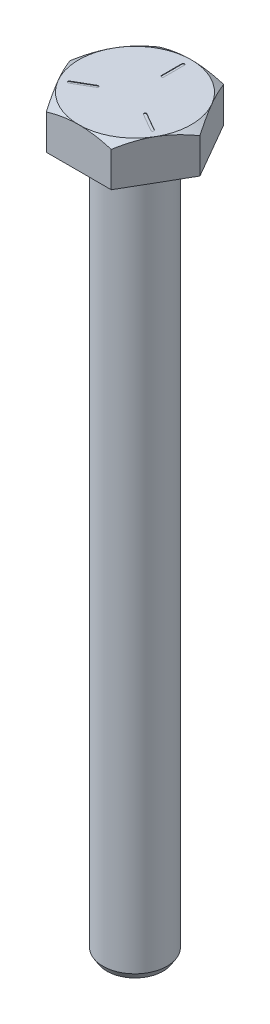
ISO-10303-21;
HEADER;
FILE_DESCRIPTION(('STEP AP214'),'2;1');
FILE_NAME('part.step','',(''),(''),'','','');
FILE_SCHEMA(('AUTOMOTIVE_DESIGN { 1 0 10303 214 1 1 1 1 }'));
ENDSEC;
DATA;
#1=APPLICATION_CONTEXT('core data for automotive mechanical design processes');
#2=APPLICATION_PROTOCOL_DEFINITION('international standard','automotive_design',2000,#1);
#3=PRODUCT_CONTEXT('',#1,'mechanical');
#4=PRODUCT('Part','Part','',(#3));
#5=PRODUCT_RELATED_PRODUCT_CATEGORY('part','',(#4));
#6=PRODUCT_DEFINITION_FORMATION('','',#4);
#7=PRODUCT_DEFINITION_CONTEXT('part definition',#1,'design');
#8=PRODUCT_DEFINITION('design','',#6,#7);
#9=PRODUCT_DEFINITION_SHAPE('','',#8);
#10=(LENGTH_UNIT() NAMED_UNIT(*) SI_UNIT(.MILLI.,.METRE.));
#11=(NAMED_UNIT(*) PLANE_ANGLE_UNIT() SI_UNIT($,.RADIAN.));
#12=(NAMED_UNIT(*) SI_UNIT($,.STERADIAN.) SOLID_ANGLE_UNIT());
#13=UNCERTAINTY_MEASURE_WITH_UNIT(LENGTH_MEASURE(1.E-05),#10,'distance_accuracy_value','');
#14=(GEOMETRIC_REPRESENTATION_CONTEXT(3) GLOBAL_UNCERTAINTY_ASSIGNED_CONTEXT((#13)) GLOBAL_UNIT_ASSIGNED_CONTEXT((#10,
#11,#12)) REPRESENTATION_CONTEXT('',''));
#15=CARTESIAN_POINT('',(0.,0.,0.));
#16=DIRECTION('',(0.,0.,1.));
#17=DIRECTION('',(1.,0.,0.));
#18=AXIS2_PLACEMENT_3D('',#15,#16,#17);
#19=CARTESIAN_POINT('',(0.,3.9624,0.));
#20=DIRECTION('',(0.,1.,0.));
#21=DIRECTION('',(0.,0.,1.));
#22=AXIS2_PLACEMENT_3D('',#19,#20,#21);
#23=PLANE('',#22);
#24=CARTESIAN_POINT('',(0.,3.9624,0.));
#25=DIRECTION('',(0.,1.,0.));
#26=DIRECTION('',(0.,0.,1.));
#27=AXIS2_PLACEMENT_3D('',#24,#25,#26);
#28=CIRCLE('',#27,5.55625);
#29=CARTESIAN_POINT('',(0.,3.9624,5.55625));
#30=VERTEX_POINT('',#29);
#31=CARTESIAN_POINT('',(-4.81185364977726,3.9624,2.77812500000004));
#32=VERTEX_POINT('',#31);
#33=EDGE_CURVE('E11',#30,#32,#28,.F.);
#34=ORIENTED_EDGE('',*,*,#33,.F.);
#35=CARTESIAN_POINT('',(0.,3.9624,0.));
#36=DIRECTION('',(0.,-1.,0.));
#37=DIRECTION('',(1.,0.,0.));
#38=AXIS2_PLACEMENT_3D('',#35,#36,#37);
#39=CIRCLE('',#38,5.55625);
#40=CARTESIAN_POINT('',(4.8118536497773,3.9624,2.77812499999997));
#41=VERTEX_POINT('',#40);
#42=EDGE_CURVE('E199',#41,#30,#39,.T.);
#43=ORIENTED_EDGE('',*,*,#42,.F.);
#44=CARTESIAN_POINT('',(4.81185364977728,3.9624,-2.778125));
#45=VERTEX_POINT('',#44);
#46=EDGE_CURVE('E42',#45,#41,#28,.F.);
#47=ORIENTED_EDGE('',*,*,#46,.F.);
#48=CARTESIAN_POINT('',(0.,3.9624,-5.55625));
#49=VERTEX_POINT('',#48);
#50=EDGE_CURVE('E521',#49,#45,#28,.F.);
#51=ORIENTED_EDGE('',*,*,#50,.F.);
#52=CARTESIAN_POINT('',(-4.8118536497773,3.9624,-2.77812499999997));
#53=VERTEX_POINT('',#52);
#54=EDGE_CURVE('E523',#53,#49,#28,.F.);
#55=ORIENTED_EDGE('',*,*,#54,.F.);
#56=EDGE_CURVE('E41',#32,#53,#28,.F.);
#57=ORIENTED_EDGE('',*,*,#56,.F.);
#58=EDGE_LOOP('',(#34,#43,#47,#51,#55,#57));
#59=FACE_BOUND('',#58,.T.);
#60=DIRECTION('',(0.866025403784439,0.,0.5));
#61=VECTOR('',#60,1.);
#62=CARTESIAN_POINT('',(4.18794598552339,3.9624,2.27126477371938));
#63=LINE('',#62,#61);
#64=CARTESIAN_POINT('',(2.42818236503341,3.9624,1.25526477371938));
#65=VERTEX_POINT('',#64);
#66=CARTESIAN_POINT('',(4.18794598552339,3.9624,2.27126477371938));
#67=VERTEX_POINT('',#66);
#68=EDGE_CURVE('E241',#65,#67,#63,.T.);
#69=ORIENTED_EDGE('',*,*,#68,.T.);
#70=CARTESIAN_POINT('',(4.12444598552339,3.9624,2.38125));
#71=DIRECTION('',(0.,-1.,0.));
#72=DIRECTION('',(0.,0.,-1.));
#73=AXIS2_PLACEMENT_3D('',#70,#71,#72);
#74=CIRCLE('',#73,0.127);
#75=CARTESIAN_POINT('',(4.06094598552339,3.9624,2.49123522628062));
#76=VERTEX_POINT('',#75);
#77=EDGE_CURVE('E248',#67,#76,#74,.T.);
#78=ORIENTED_EDGE('',*,*,#77,.T.);
#79=DIRECTION('',(-0.866025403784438,0.,-0.5));
#80=VECTOR('',#79,1.);
#81=CARTESIAN_POINT('',(4.06094598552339,3.9624,2.49123522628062));
#82=LINE('',#81,#80);
#83=CARTESIAN_POINT('',(2.30118236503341,3.9624,1.47523522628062));
#84=VERTEX_POINT('',#83);
#85=EDGE_CURVE('E251',#76,#84,#82,.T.);
#86=ORIENTED_EDGE('',*,*,#85,.T.);
#87=CARTESIAN_POINT('',(2.36468236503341,3.9624,1.36525));
#88=DIRECTION('',(0.,-1.,0.));
#89=DIRECTION('',(0.,0.,-1.));
#90=AXIS2_PLACEMENT_3D('',#87,#88,#89);
#91=CIRCLE('',#90,0.127);
#92=EDGE_CURVE('E255',#84,#65,#91,.T.);
#93=ORIENTED_EDGE('',*,*,#92,.T.);
#94=EDGE_LOOP('',(#69,#78,#86,#93));
#95=FACE_BOUND('',#94,.T.);
#96=DIRECTION('',(-0.866025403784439,0.,0.5));
#97=VECTOR('',#96,1.);
#98=CARTESIAN_POINT('',(-4.06094598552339,3.9624,2.49123522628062));
#99=LINE('',#98,#97);
#100=CARTESIAN_POINT('',(-2.30118236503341,3.9624,1.47523522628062));
#101=VERTEX_POINT('',#100);
#102=CARTESIAN_POINT('',(-4.06094598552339,3.9624,2.49123522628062));
#103=VERTEX_POINT('',#102);
#104=EDGE_CURVE('E213',#101,#103,#99,.T.);
#105=ORIENTED_EDGE('',*,*,#104,.T.);
#106=CARTESIAN_POINT('',(-4.12444598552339,3.9624,2.38125));
#107=DIRECTION('',(0.,-1.,0.));
#108=DIRECTION('',(0.,0.,-1.));
#109=AXIS2_PLACEMENT_3D('',#106,#107,#108);
#110=CIRCLE('',#109,0.127);
#111=CARTESIAN_POINT('',(-4.18794598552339,3.9624,2.27126477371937));
#112=VERTEX_POINT('',#111);
#113=EDGE_CURVE('E57',#103,#112,#110,.T.);
#114=ORIENTED_EDGE('',*,*,#113,.T.);
#115=DIRECTION('',(0.866025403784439,0.,-0.5));
#116=VECTOR('',#115,1.);
#117=CARTESIAN_POINT('',(-4.18794598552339,3.9624,2.27126477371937));
#118=LINE('',#117,#116);
#119=CARTESIAN_POINT('',(-2.42818236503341,3.9624,1.25526477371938));
#120=VERTEX_POINT('',#119);
#121=EDGE_CURVE('E221',#112,#120,#118,.T.);
#122=ORIENTED_EDGE('',*,*,#121,.T.);
#123=CARTESIAN_POINT('',(-2.36468236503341,3.9624,1.36525));
#124=DIRECTION('',(0.,-1.,0.));
#125=DIRECTION('',(0.,0.,-1.));
#126=AXIS2_PLACEMENT_3D('',#123,#124,#125);
#127=CIRCLE('',#126,0.127);
#128=EDGE_CURVE('E225',#120,#101,#127,.T.);
#129=ORIENTED_EDGE('',*,*,#128,.T.);
#130=EDGE_LOOP('',(#105,#114,#122,#129));
#131=FACE_BOUND('',#130,.T.);
#132=DIRECTION('',(0.,0.,-1.));
#133=VECTOR('',#132,1.);
#134=CARTESIAN_POINT('',(-0.127,3.9624,-4.7625));
#135=LINE('',#134,#133);
#136=CARTESIAN_POINT('',(-0.127,3.9624,-2.7305));
#137=VERTEX_POINT('',#136);
#138=CARTESIAN_POINT('',(-0.127,3.9624,-4.7625));
#139=VERTEX_POINT('',#138);
#140=EDGE_CURVE('E194',#137,#139,#135,.T.);
#141=ORIENTED_EDGE('',*,*,#140,.T.);
#142=CARTESIAN_POINT('',(0.,3.9624,-4.7625));
#143=DIRECTION('',(0.,-1.,0.));
#144=DIRECTION('',(0.,0.,-1.));
#145=AXIS2_PLACEMENT_3D('',#142,#143,#144);
#146=CIRCLE('',#145,0.127);
#147=CARTESIAN_POINT('',(0.127,3.9624,-4.7625));
#148=VERTEX_POINT('',#147);
#149=EDGE_CURVE('E49',#139,#148,#146,.T.);
#150=ORIENTED_EDGE('',*,*,#149,.T.);
#151=DIRECTION('',(0.,0.,1.));
#152=VECTOR('',#151,1.);
#153=CARTESIAN_POINT('',(0.127,3.9624,-4.7625));
#154=LINE('',#153,#152);
#155=CARTESIAN_POINT('',(0.127,3.9624,-2.7305));
#156=VERTEX_POINT('',#155);
#157=EDGE_CURVE('E198',#148,#156,#154,.T.);
#158=ORIENTED_EDGE('',*,*,#157,.T.);
#159=CARTESIAN_POINT('',(0.,3.9624,-2.7305));
#160=DIRECTION('',(0.,-1.,0.));
#161=DIRECTION('',(0.,0.,-1.));
#162=AXIS2_PLACEMENT_3D('',#159,#160,#161);
#163=CIRCLE('',#162,0.127);
#164=EDGE_CURVE('E372',#156,#137,#163,.T.);
#165=ORIENTED_EDGE('',*,*,#164,.T.);
#166=EDGE_LOOP('',(#141,#150,#158,#165));
#167=FACE_BOUND('',#166,.T.);
#168=ADVANCED_FACE('F32',(#59,#95,#131,#167),#23,.T.);
#169=CARTESIAN_POINT('',(3.20790243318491,3.9624,5.55624999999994));
#170=DIRECTION('',(-0.866025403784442,0.,-0.499999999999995));
#171=DIRECTION('',(-0.499999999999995,0.,0.866025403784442));
#172=AXIS2_PLACEMENT_3D('',#169,#170,#171);
#173=PLANE('',#172);
#174=DIRECTION('',(0.,-1.,0.));
#175=VECTOR('',#174,1.);
#176=CARTESIAN_POINT('',(6.41580486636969,3.9624,0.));
#177=LINE('',#176,#175);
#178=CARTESIAN_POINT('',(6.41580486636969,3.4544,0.));
#179=VERTEX_POINT('',#178);
#180=CARTESIAN_POINT('',(6.41580486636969,0.,0.));
#181=VERTEX_POINT('',#180);
#182=EDGE_CURVE('E498',#179,#181,#177,.T.);
#183=ORIENTED_EDGE('',*,*,#182,.F.);
#184=CARTESIAN_POINT('',(6.41592033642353,3.45433175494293,-0.0002));
#185=CARTESIAN_POINT('',(6.34525728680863,3.49608770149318,0.122191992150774));
#186=CARTESIAN_POINT('',(6.2743186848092,3.53595207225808,0.245061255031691));
#187=CARTESIAN_POINT('',(6.13183759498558,3.61136937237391,0.491845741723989));
#188=CARTESIAN_POINT('',(6.06029484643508,3.64692032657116,0.615761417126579));
#189=CARTESIAN_POINT('',(5.84446209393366,3.74640067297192,0.989594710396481));
#190=CARTESIAN_POINT('',(5.69927852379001,3.8029688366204,1.24106003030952));
#191=CARTESIAN_POINT('',(5.48203887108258,3.86918211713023,1.61733014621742));
#192=CARTESIAN_POINT('',(5.41066401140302,3.88801355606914,1.74095502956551));
#193=CARTESIAN_POINT('',(5.26757723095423,3.91954792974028,1.98878860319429));
#194=CARTESIAN_POINT('',(5.19586534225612,3.9322514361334,2.11299723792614));
#195=CARTESIAN_POINT('',(5.05231394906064,3.95119916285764,2.361635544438));
#196=CARTESIAN_POINT('',(4.980474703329,3.9574511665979,2.48606476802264));
#197=CARTESIAN_POINT('',(4.83673361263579,3.96336736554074,2.73503164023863));
#198=CARTESIAN_POINT('',(4.76483176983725,3.9630317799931,2.85956928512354));
#199=CARTESIAN_POINT('',(4.56856862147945,3.9530985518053,3.19950702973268));
#200=CARTESIAN_POINT('',(4.44427753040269,3.93691024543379,3.41478551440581));
#201=CARTESIAN_POINT('',(4.19656247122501,3.88592740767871,3.84384058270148));
#202=CARTESIAN_POINT('',(4.07313946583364,3.85111476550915,4.0576154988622));
#203=CARTESIAN_POINT('',(3.82491070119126,3.76422634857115,4.48756033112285));
#204=CARTESIAN_POINT('',(3.70013908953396,3.71176954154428,4.70367110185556));
#205=CARTESIAN_POINT('',(3.45253692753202,3.5928355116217,5.13253062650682));
#206=CARTESIAN_POINT('',(3.32970290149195,3.52638745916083,5.34528540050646));
#207=CARTESIAN_POINT('',(3.20778696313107,3.45433175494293,5.55644999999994));
#208=B_SPLINE_CURVE_WITH_KNOTS('',3,(#184,#185,#186,#187,#188,#189,#190,#191,#192,#193,#194,
#195,#196,#197,#198,#199,#200,#201,#202,#203,#204,#205,#206,#207),.UNSPECIFIED.,.F.,.F.,(4,2,2,
2,2,2,2,2,2,2,2,4),(0.,0.442059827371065,0.884321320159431,1.77079067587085,2.20264380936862,
2.63445664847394,3.06574791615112,3.49702482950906,4.2435368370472,4.99077609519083,
5.7553162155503,6.51827785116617),.UNSPECIFIED.);
#209=EDGE_CURVE('E495',#179,#41,#208,.T.);
#210=ORIENTED_EDGE('',*,*,#209,.T.);
#211=CARTESIAN_POINT('',(3.20790243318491,3.4544,5.55624999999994));
#212=VERTEX_POINT('',#211);
#213=EDGE_CURVE('E304',#41,#212,#208,.T.);
#214=ORIENTED_EDGE('',*,*,#213,.T.);
#215=DIRECTION('',(0.,-1.,0.));
#216=VECTOR('',#215,1.);
#217=CARTESIAN_POINT('',(3.20790243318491,3.9624,5.55624999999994));
#218=LINE('',#217,#216);
#219=CARTESIAN_POINT('',(3.20790243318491,0.,5.55624999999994));
#220=VERTEX_POINT('',#219);
#221=EDGE_CURVE('E503',#212,#220,#218,.T.);
#222=ORIENTED_EDGE('',*,*,#221,.T.);
#223=DIRECTION('',(0.499999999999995,0.,-0.866025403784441));
#224=VECTOR('',#223,1.);
#225=CARTESIAN_POINT('',(3.20790243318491,0.,5.55624999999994));
#226=LINE('',#225,#224);
#227=EDGE_CURVE('E539',#220,#181,#226,.T.);
#228=ORIENTED_EDGE('',*,*,#227,.T.);
#229=EDGE_LOOP('',(#183,#210,#214,#222,#228));
#230=FACE_BOUND('',#229,.T.);
#231=ADVANCED_FACE('F34',(#230),#173,.F.);
#232=CARTESIAN_POINT('',(6.41580486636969,3.9624,0.));
#233=DIRECTION('',(-0.866025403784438,0.,0.500000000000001));
#234=DIRECTION('',(0.500000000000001,0.,0.866025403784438));
#235=AXIS2_PLACEMENT_3D('',#232,#233,#234);
#236=PLANE('',#235);
#237=DIRECTION('',(0.,-1.,0.));
#238=VECTOR('',#237,1.);
#239=CARTESIAN_POINT('',(3.20790243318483,3.9624,-5.55624999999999));
#240=LINE('',#239,#238);
#241=CARTESIAN_POINT('',(3.20790243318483,3.4544,-5.55624999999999));
#242=VERTEX_POINT('',#241);
#243=CARTESIAN_POINT('',(3.20790243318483,0.,-5.55624999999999));
#244=VERTEX_POINT('',#243);
#245=EDGE_CURVE('E518',#242,#244,#240,.T.);
#246=ORIENTED_EDGE('',*,*,#245,.F.);
#247=CARTESIAN_POINT('',(3.20778696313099,3.45433175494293,-5.55644999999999));
#248=CARTESIAN_POINT('',(3.2784500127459,3.49608770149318,-5.43405800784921));
#249=CARTESIAN_POINT('',(3.34938861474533,3.53595207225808,-5.3111887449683));
#250=CARTESIAN_POINT('',(3.49186970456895,3.61136937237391,-5.064404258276));
#251=CARTESIAN_POINT('',(3.56341245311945,3.64692032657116,-4.94048858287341));
#252=CARTESIAN_POINT('',(3.77924520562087,3.74640067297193,-4.56665528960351));
#253=CARTESIAN_POINT('',(3.92442877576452,3.80296883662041,-4.31518996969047));
#254=CARTESIAN_POINT('',(4.14166842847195,3.86918211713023,-3.93891985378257));
#255=CARTESIAN_POINT('',(4.21304328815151,3.88801355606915,-3.81529497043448));
#256=CARTESIAN_POINT('',(4.35613006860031,3.91954792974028,-3.56746139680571));
#257=CARTESIAN_POINT('',(4.42784195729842,3.93225143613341,-3.44325276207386));
#258=CARTESIAN_POINT('',(4.5713933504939,3.95119916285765,-3.194614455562));
#259=CARTESIAN_POINT('',(4.64323259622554,3.95745116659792,-3.07018523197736));
#260=CARTESIAN_POINT('',(4.78697368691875,3.96336736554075,-2.82121835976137));
#261=CARTESIAN_POINT('',(4.85887552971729,3.96303177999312,-2.69668071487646));
#262=CARTESIAN_POINT('',(5.0551386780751,3.95309855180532,-2.35674297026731));
#263=CARTESIAN_POINT('',(5.17942976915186,3.9369102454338,-2.14146448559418));
#264=CARTESIAN_POINT('',(5.42714482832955,3.88592740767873,-1.7124094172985));
#265=CARTESIAN_POINT('',(5.55056783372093,3.85111476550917,-1.49863450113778));
#266=CARTESIAN_POINT('',(5.79879659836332,3.76422634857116,-1.06868966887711));
#267=CARTESIAN_POINT('',(5.92356821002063,3.71176954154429,-0.852578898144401));
#268=CARTESIAN_POINT('',(6.17117037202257,3.59283551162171,-0.423719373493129));
#269=CARTESIAN_POINT('',(6.29400439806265,3.52638745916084,-0.210964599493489));
#270=CARTESIAN_POINT('',(6.41592033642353,3.45433175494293,0.000200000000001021));
#271=B_SPLINE_CURVE_WITH_KNOTS('',3,(#247,#248,#249,#250,#251,#252,#253,#254,#255,#256,#257,
#258,#259,#260,#261,#262,#263,#264,#265,#266,#267,#268,#269,#270),.UNSPECIFIED.,.F.,.F.,(4,2,2,
2,2,2,2,2,2,2,2,4),(0.,0.442059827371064,0.884321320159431,1.77079067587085,2.20264380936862,
2.63445664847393,3.06574791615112,3.49702482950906,4.24353683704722,4.99077609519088,
5.75531621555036,6.51827785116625),.UNSPECIFIED.);
#272=EDGE_CURVE('E323',#242,#45,#271,.T.);
#273=ORIENTED_EDGE('',*,*,#272,.T.);
#274=EDGE_CURVE('E317',#45,#179,#271,.T.);
#275=ORIENTED_EDGE('',*,*,#274,.T.);
#276=ORIENTED_EDGE('',*,*,#182,.T.);
#277=DIRECTION('',(-0.500000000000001,0.,-0.866025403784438));
#278=VECTOR('',#277,1.);
#279=CARTESIAN_POINT('',(6.41580486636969,0.,0.));
#280=LINE('',#279,#278);
#281=EDGE_CURVE('E540',#181,#244,#280,.T.);
#282=ORIENTED_EDGE('',*,*,#281,.T.);
#283=EDGE_LOOP('',(#246,#273,#275,#276,#282));
#284=FACE_BOUND('',#283,.T.);
#285=ADVANCED_FACE('F331',(#284),#236,.F.);
#286=CARTESIAN_POINT('',(3.20790243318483,3.9624,-5.55624999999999));
#287=DIRECTION('',(0.,0.,1.));
#288=DIRECTION('',(1.,0.,0.));
#289=AXIS2_PLACEMENT_3D('',#286,#287,#288);
#290=PLANE('',#289);
#291=DIRECTION('',(0.,-1.,0.));
#292=VECTOR('',#291,1.);
#293=CARTESIAN_POINT('',(-3.20790243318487,3.9624,-5.55624999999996));
#294=LINE('',#293,#292);
#295=CARTESIAN_POINT('',(-3.20790243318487,3.4544,-5.55624999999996));
#296=VERTEX_POINT('',#295);
#297=CARTESIAN_POINT('',(-3.20790243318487,0.,-5.55624999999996));
#298=VERTEX_POINT('',#297);
#299=EDGE_CURVE('E516',#296,#298,#294,.T.);
#300=ORIENTED_EDGE('',*,*,#299,.F.);
#301=CARTESIAN_POINT('',(-9.64398746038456,0.668253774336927,-5.55624999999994));
#302=CARTESIAN_POINT('',(-9.41845867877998,0.783728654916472,-5.55624999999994));
#303=CARTESIAN_POINT('',(-9.19253036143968,0.898430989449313,-5.55624999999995));
#304=CARTESIAN_POINT('',(-8.73969781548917,1.12592725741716,-5.55624999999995));
#305=CARTESIAN_POINT('',(-8.51279352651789,1.23872107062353,-5.55624999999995));
#306=CARTESIAN_POINT('',(-8.05743404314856,1.46223170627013,-5.55624999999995));
#307=CARTESIAN_POINT('',(-7.82897673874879,1.57294423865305,-5.55624999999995));
#308=CARTESIAN_POINT('',(-7.37073056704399,1.79157256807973,-5.55624999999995));
#309=CARTESIAN_POINT('',(-7.14094172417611,1.89948841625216,-5.55624999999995));
#310=CARTESIAN_POINT('',(-6.6692381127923,2.11674940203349,-5.55624999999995));
#311=CARTESIAN_POINT('',(-6.42724930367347,2.22593428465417,-5.55624999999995));
#312=CARTESIAN_POINT('',(-5.94121021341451,2.43961089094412,-5.55624999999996));
#313=CARTESIAN_POINT('',(-5.69715999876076,2.5441027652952,-5.55624999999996));
#314=CARTESIAN_POINT('',(-5.20672896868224,2.7471044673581,-5.55624999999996));
#315=CARTESIAN_POINT('',(-4.96034952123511,2.84561758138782,-5.55624999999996));
#316=CARTESIAN_POINT('',(-4.46471370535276,3.03508638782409,-5.55624999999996));
#317=CARTESIAN_POINT('',(-4.21545762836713,3.12604283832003,-5.55624999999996));
#318=CARTESIAN_POINT('',(-3.65491811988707,3.31847041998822,-5.55624999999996));
#319=CARTESIAN_POINT('',(-3.34275939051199,3.41742695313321,-5.55624999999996));
#320=CARTESIAN_POINT('',(-2.71269101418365,3.59558398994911,-5.55624999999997));
#321=CARTESIAN_POINT('',(-2.39478151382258,3.67478499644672,-5.55624999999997));
#322=CARTESIAN_POINT('',(-1.91666726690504,3.77360947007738,-5.55624999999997));
#323=CARTESIAN_POINT('',(-1.75847647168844,3.80304839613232,-5.55624999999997));
#324=CARTESIAN_POINT('',(-1.44096533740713,3.85496489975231,-5.55624999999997));
#325=CARTESIAN_POINT('',(-1.2816451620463,3.87744346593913,-5.55624999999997));
#326=CARTESIAN_POINT('',(-0.962160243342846,3.91481307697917,-5.55624999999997));
#327=CARTESIAN_POINT('',(-0.801995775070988,3.92970645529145,-5.55624999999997));
#328=CARTESIAN_POINT('',(-0.481117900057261,3.95145821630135,-5.55624999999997));
#329=CARTESIAN_POINT('',(-0.320404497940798,3.9583166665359,-5.55624999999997));
#330=CARTESIAN_POINT('',(0.00254855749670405,3.96379729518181,-5.55624999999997));
#331=CARTESIAN_POINT('',(0.164789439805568,3.96234806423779,-5.55624999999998));
#332=CARTESIAN_POINT('',(0.488978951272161,3.95109605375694,-5.55624999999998));
#333=CARTESIAN_POINT('',(0.650927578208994,3.9412932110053,-5.55624999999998));
#334=CARTESIAN_POINT('',(0.974174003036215,3.91365045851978,-5.55624999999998));
#335=CARTESIAN_POINT('',(1.1354716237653,3.89580849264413,-5.55624999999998));
#336=CARTESIAN_POINT('',(1.45706960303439,3.85262859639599,-5.55624999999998));
#337=CARTESIAN_POINT('',(1.61736980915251,3.82728954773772,-5.55624999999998));
#338=CARTESIAN_POINT('',(2.10204742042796,3.74002376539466,-5.55624999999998));
#339=CARTESIAN_POINT('',(2.42451495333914,3.66737375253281,-5.55624999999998));
#340=CARTESIAN_POINT('',(3.06356333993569,3.50016427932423,-5.55624999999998));
#341=CARTESIAN_POINT('',(3.38014339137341,3.40560185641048,-5.55624999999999));
#342=CARTESIAN_POINT('',(3.95798444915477,3.21651884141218,-5.55624999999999));
#343=CARTESIAN_POINT('',(4.22003782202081,3.12438216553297,-5.55624999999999));
#344=CARTESIAN_POINT('',(4.74084627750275,2.93117288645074,-5.55624999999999));
#345=CARTESIAN_POINT('',(4.99960089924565,2.83009904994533,-5.55624999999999));
#346=CARTESIAN_POINT('',(5.51448209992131,2.62096288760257,-5.55624999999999));
#347=CARTESIAN_POINT('',(5.77060652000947,2.51289528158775,-5.55624999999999));
#348=CARTESIAN_POINT('',(6.28048347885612,2.29136310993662,-5.55625));
#349=CARTESIAN_POINT('',(6.53423614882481,2.17789884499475,-5.55625));
#350=CARTESIAN_POINT('',(7.02823725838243,1.95198859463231,-5.55625));
#351=CARTESIAN_POINT('',(7.26857302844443,1.83973290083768,-5.55625));
#352=CARTESIAN_POINT('',(7.74775886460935,1.61208629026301,-5.55625));
#353=CARTESIAN_POINT('',(7.98660889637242,1.49669530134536,-5.55625));
#354=CARTESIAN_POINT('',(8.4624876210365,1.26364627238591,-5.55625));
#355=CARTESIAN_POINT('',(8.69951930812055,1.14599433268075,-5.55625));
#356=CARTESIAN_POINT('',(9.17250797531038,0.90859257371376,-5.55625));
#357=CARTESIAN_POINT('',(9.40846503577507,0.788842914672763,-5.55625000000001));
#358=CARTESIAN_POINT('',(9.64398746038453,0.668253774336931,-5.55625000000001));
#359=B_SPLINE_CURVE_WITH_KNOTS('',3,(#301,#302,#303,#304,#305,#306,#307,#308,#309,#310,#311,
#312,#313,#314,#315,#316,#317,#318,#319,#320,#321,#322,#323,#324,#325,#326,#327,#328,#329,#330,
#331,#332,#333,#334,#335,#336,#337,#338,#339,#340,#341,#342,#343,#344,#345,#346,#347,#348,#349,
#350,#351,#352,#353,#354,#355,#356,#357,#358),.UNSPECIFIED.,.F.,.F.,(4,2,2,2,2,2,2,2,2,2,2,2,2,
2,2,2,2,2,2,2,2,2,2,2,2,2,2,2,4),(0.,0.760121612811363,1.52029093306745,2.28188531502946,
3.04346576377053,3.8398678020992,4.63624425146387,5.43217891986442,6.22803364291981,
7.2099847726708,8.19191090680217,8.67450244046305,9.15702539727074,9.63939982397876,
10.1217701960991,10.6082930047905,11.0948194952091,11.5814704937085,12.0681941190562,
13.0587120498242,14.0493639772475,14.8825044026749,15.7157599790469,16.5496521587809,
17.3834979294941,18.1792496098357,18.9750196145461,19.7688812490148,20.5626825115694),.UNSPECIFIED.);
#360=EDGE_CURVE('E536',#296,#49,#359,.T.);
#361=ORIENTED_EDGE('',*,*,#360,.T.);
#362=EDGE_CURVE('E324',#49,#242,#359,.T.);
#363=ORIENTED_EDGE('',*,*,#362,.T.);
#364=ORIENTED_EDGE('',*,*,#245,.T.);
#365=DIRECTION('',(-1.,0.,0.));
#366=VECTOR('',#365,1.);
#367=CARTESIAN_POINT('',(3.20790243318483,0.,-5.55624999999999));
#368=LINE('',#367,#366);
#369=EDGE_CURVE('E541',#244,#298,#368,.T.);
#370=ORIENTED_EDGE('',*,*,#369,.T.);
#371=EDGE_LOOP('',(#300,#361,#363,#364,#370));
#372=FACE_BOUND('',#371,.T.);
#373=ADVANCED_FACE('F334',(#372),#290,.F.);
#374=CARTESIAN_POINT('',(-3.20790243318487,3.9624,-5.55624999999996));
#375=DIRECTION('',(0.866025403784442,0.,0.499999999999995));
#376=DIRECTION('',(0.499999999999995,0.,-0.866025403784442));
#377=AXIS2_PLACEMENT_3D('',#374,#375,#376);
#378=PLANE('',#377);
#379=DIRECTION('',(0.,-1.,0.));
#380=VECTOR('',#379,1.);
#381=CARTESIAN_POINT('',(-6.41580486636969,3.9624,0.));
#382=LINE('',#381,#380);
#383=CARTESIAN_POINT('',(-6.41580486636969,3.4544,0.));
#384=VERTEX_POINT('',#383);
#385=CARTESIAN_POINT('',(-6.41580486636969,0.,0.));
#386=VERTEX_POINT('',#385);
#387=EDGE_CURVE('E509',#384,#386,#382,.T.);
#388=ORIENTED_EDGE('',*,*,#387,.F.);
#389=CARTESIAN_POINT('',(-6.41592033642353,3.45433175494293,0.000200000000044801));
#390=CARTESIAN_POINT('',(-6.34525728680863,3.49608770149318,-0.122191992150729));
#391=CARTESIAN_POINT('',(-6.2743186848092,3.53595207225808,-0.245061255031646));
#392=CARTESIAN_POINT('',(-6.13183759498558,3.61136937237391,-0.491845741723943));
#393=CARTESIAN_POINT('',(-6.06029484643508,3.64692032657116,-0.615761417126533));
#394=CARTESIAN_POINT('',(-5.84446209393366,3.74640067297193,-0.989594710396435));
#395=CARTESIAN_POINT('',(-5.69927852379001,3.80296883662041,-1.24106003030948));
#396=CARTESIAN_POINT('',(-5.48203887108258,3.86918211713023,-1.61733014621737));
#397=CARTESIAN_POINT('',(-5.41066401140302,3.88801355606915,-1.74095502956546));
#398=CARTESIAN_POINT('',(-5.26757723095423,3.91954792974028,-1.98878860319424));
#399=CARTESIAN_POINT('',(-5.19586534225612,3.93225143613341,-2.11299723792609));
#400=CARTESIAN_POINT('',(-5.05231394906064,3.95119916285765,-2.36163554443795));
#401=CARTESIAN_POINT('',(-4.980474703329,3.95745116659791,-2.48606476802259));
#402=CARTESIAN_POINT('',(-4.83673361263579,3.96336736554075,-2.73503164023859));
#403=CARTESIAN_POINT('',(-4.76483176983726,3.96303177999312,-2.85956928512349));
#404=CARTESIAN_POINT('',(-4.56856862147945,3.95309855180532,-3.19950702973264));
#405=CARTESIAN_POINT('',(-4.44427753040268,3.9369102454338,-3.41478551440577));
#406=CARTESIAN_POINT('',(-4.196562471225,3.88592740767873,-3.84384058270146));
#407=CARTESIAN_POINT('',(-4.07313946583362,3.85111476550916,-4.05761549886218));
#408=CARTESIAN_POINT('',(-3.82491070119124,3.76422634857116,-4.48756033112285));
#409=CARTESIAN_POINT('',(-3.70013908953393,3.71176954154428,-4.70367110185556));
#410=CARTESIAN_POINT('',(-3.45253692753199,3.59283551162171,-5.13253062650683));
#411=CARTESIAN_POINT('',(-3.32970290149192,3.52638745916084,-5.34528540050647));
#412=CARTESIAN_POINT('',(-3.20778696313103,3.45433175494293,-5.55644999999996));
#413=B_SPLINE_CURVE_WITH_KNOTS('',3,(#389,#390,#391,#392,#393,#394,#395,#396,#397,#398,#399,
#400,#401,#402,#403,#404,#405,#406,#407,#408,#409,#410,#411,#412),.UNSPECIFIED.,.F.,.F.,(4,2,2,
2,2,2,2,2,2,2,2,4),(0.,0.442059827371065,0.88432132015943,1.77079067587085,2.20264380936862,
2.63445664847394,3.06574791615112,3.49702482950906,4.24353683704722,4.99077609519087,
5.75531621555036,6.51827785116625),.UNSPECIFIED.);
#414=EDGE_CURVE('E310',#384,#53,#413,.T.);
#415=ORIENTED_EDGE('',*,*,#414,.T.);
#416=EDGE_CURVE('E532',#53,#296,#413,.T.);
#417=ORIENTED_EDGE('',*,*,#416,.T.);
#418=ORIENTED_EDGE('',*,*,#299,.T.);
#419=DIRECTION('',(-0.499999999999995,0.,0.866025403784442));
#420=VECTOR('',#419,1.);
#421=CARTESIAN_POINT('',(-3.20790243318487,0.,-5.55624999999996));
#422=LINE('',#421,#420);
#423=EDGE_CURVE('E545',#298,#386,#422,.T.);
#424=ORIENTED_EDGE('',*,*,#423,.T.);
#425=EDGE_LOOP('',(#388,#415,#417,#418,#424));
#426=FACE_BOUND('',#425,.T.);
#427=ADVANCED_FACE('F338',(#426),#378,.F.);
#428=CARTESIAN_POINT('',(-6.41580486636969,3.9624,0.));
#429=DIRECTION('',(0.866025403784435,0.,-0.500000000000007));
#430=DIRECTION('',(-0.500000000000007,0.,-0.866025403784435));
#431=AXIS2_PLACEMENT_3D('',#428,#429,#430);
#432=PLANE('',#431);
#433=DIRECTION('',(0.,-1.,0.));
#434=VECTOR('',#433,1.);
#435=CARTESIAN_POINT('',(-3.20790243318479,3.9624,5.55625000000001));
#436=LINE('',#435,#434);
#437=CARTESIAN_POINT('',(-3.20790243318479,3.4544,5.55625000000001));
#438=VERTEX_POINT('',#437);
#439=CARTESIAN_POINT('',(-3.20790243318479,0.,5.55625000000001));
#440=VERTEX_POINT('',#439);
#441=EDGE_CURVE('E507',#438,#440,#436,.T.);
#442=ORIENTED_EDGE('',*,*,#441,.F.);
#443=CARTESIAN_POINT('',(-3.20778696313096,3.45433175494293,5.55645000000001));
#444=CARTESIAN_POINT('',(-3.27845001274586,3.49608770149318,5.43405800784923));
#445=CARTESIAN_POINT('',(-3.34938861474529,3.53595207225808,5.31118874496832));
#446=CARTESIAN_POINT('',(-3.49186970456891,3.61136937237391,5.06440425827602));
#447=CARTESIAN_POINT('',(-3.56341245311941,3.64692032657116,4.94048858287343));
#448=CARTESIAN_POINT('',(-3.77924520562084,3.74640067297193,4.56665528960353));
#449=CARTESIAN_POINT('',(-3.92442877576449,3.80296883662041,4.3151899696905));
#450=CARTESIAN_POINT('',(-4.14166842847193,3.86918211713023,3.9389198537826));
#451=CARTESIAN_POINT('',(-4.21304328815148,3.88801355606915,3.81529497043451));
#452=CARTESIAN_POINT('',(-4.35613006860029,3.91954792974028,3.56746139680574));
#453=CARTESIAN_POINT('',(-4.4278419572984,3.93225143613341,3.44325276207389));
#454=CARTESIAN_POINT('',(-4.57139335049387,3.95119916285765,3.19461445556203));
#455=CARTESIAN_POINT('',(-4.64323259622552,3.95745116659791,3.07018523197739));
#456=CARTESIAN_POINT('',(-4.78697368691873,3.96336736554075,2.8212183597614));
#457=CARTESIAN_POINT('',(-4.85887552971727,3.96303177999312,2.6966807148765));
#458=CARTESIAN_POINT('',(-5.05513867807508,3.95309855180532,2.35674297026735));
#459=CARTESIAN_POINT('',(-5.17942976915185,3.9369102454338,2.14146448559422));
#460=CARTESIAN_POINT('',(-5.42714482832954,3.88592740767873,1.71240941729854));
#461=CARTESIAN_POINT('',(-5.55056783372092,3.85111476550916,1.49863450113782));
#462=CARTESIAN_POINT('',(-5.79879659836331,3.76422634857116,1.06868966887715));
#463=CARTESIAN_POINT('',(-5.92356821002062,3.71176954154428,0.852578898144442));
#464=CARTESIAN_POINT('',(-6.17117037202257,3.5928355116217,0.423719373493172));
#465=CARTESIAN_POINT('',(-6.29400439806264,3.52638745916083,0.210964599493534));
#466=CARTESIAN_POINT('',(-6.41592033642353,3.45433175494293,-0.000199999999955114));
#467=B_SPLINE_CURVE_WITH_KNOTS('',3,(#443,#444,#445,#446,#447,#448,#449,#450,#451,#452,#453,
#454,#455,#456,#457,#458,#459,#460,#461,#462,#463,#464,#465,#466),.UNSPECIFIED.,.F.,.F.,(4,2,2,
2,2,2,2,2,2,2,2,4),(0.,0.442059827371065,0.88432132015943,1.77079067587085,2.20264380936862,
2.63445664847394,3.06574791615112,3.49702482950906,4.24353683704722,4.99077609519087,
5.75531621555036,6.51827785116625),.UNSPECIFIED.);
#468=EDGE_CURVE('E277',#438,#32,#467,.T.);
#469=ORIENTED_EDGE('',*,*,#468,.T.);
#470=EDGE_CURVE('E499',#32,#384,#467,.T.);
#471=ORIENTED_EDGE('',*,*,#470,.T.);
#472=ORIENTED_EDGE('',*,*,#387,.T.);
#473=DIRECTION('',(0.500000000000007,0.,0.866025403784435));
#474=VECTOR('',#473,1.);
#475=CARTESIAN_POINT('',(-6.41580486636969,0.,0.));
#476=LINE('',#475,#474);
#477=EDGE_CURVE('E511',#386,#440,#476,.T.);
#478=ORIENTED_EDGE('',*,*,#477,.T.);
#479=EDGE_LOOP('',(#442,#469,#471,#472,#478));
#480=FACE_BOUND('',#479,.T.);
#481=ADVANCED_FACE('F342',(#480),#432,.F.);
#482=CARTESIAN_POINT('',(-3.20790243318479,3.9624,5.55625000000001));
#483=DIRECTION('',(0.,0.,-1.));
#484=DIRECTION('',(-1.,0.,0.));
#485=AXIS2_PLACEMENT_3D('',#482,#483,#484);
#486=PLANE('',#485);
#487=ORIENTED_EDGE('',*,*,#221,.F.);
#488=CARTESIAN_POINT('',(9.6439874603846,0.668253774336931,5.55624999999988));
#489=CARTESIAN_POINT('',(9.41845867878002,0.783728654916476,5.55624999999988));
#490=CARTESIAN_POINT('',(9.19253036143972,0.898430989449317,5.55624999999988));
#491=CARTESIAN_POINT('',(8.7396978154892,1.12592725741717,5.55624999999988));
#492=CARTESIAN_POINT('',(8.51279352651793,1.23872107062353,5.55624999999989));
#493=CARTESIAN_POINT('',(8.0574340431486,1.46223170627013,5.55624999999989));
#494=CARTESIAN_POINT('',(7.82897673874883,1.57294423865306,5.55624999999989));
#495=CARTESIAN_POINT('',(7.37073056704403,1.79157256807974,5.5562499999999));
#496=CARTESIAN_POINT('',(7.14094172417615,1.89948841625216,5.5562499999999));
#497=CARTESIAN_POINT('',(6.66923811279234,2.11674940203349,5.55624999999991));
#498=CARTESIAN_POINT('',(6.42724930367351,2.22593428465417,5.55624999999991));
#499=CARTESIAN_POINT('',(5.94121021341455,2.43961089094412,5.55624999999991));
#500=CARTESIAN_POINT('',(5.6971599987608,2.54410276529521,5.55624999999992));
#501=CARTESIAN_POINT('',(5.20672896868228,2.7471044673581,5.55624999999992));
#502=CARTESIAN_POINT('',(4.96034952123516,2.84561758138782,5.55624999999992));
#503=CARTESIAN_POINT('',(4.4647137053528,3.03508638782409,5.55624999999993));
#504=CARTESIAN_POINT('',(4.21545762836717,3.12604283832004,5.55624999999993));
#505=CARTESIAN_POINT('',(3.65491811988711,3.31847041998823,5.55624999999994));
#506=CARTESIAN_POINT('',(3.34275939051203,3.41742695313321,5.55624999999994));
#507=CARTESIAN_POINT('',(2.71269101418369,3.59558398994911,5.55624999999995));
#508=CARTESIAN_POINT('',(2.39478151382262,3.67478499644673,5.55624999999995));
#509=CARTESIAN_POINT('',(1.91666726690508,3.77360947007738,5.55624999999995));
#510=CARTESIAN_POINT('',(1.75847647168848,3.80304839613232,5.55624999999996));
#511=CARTESIAN_POINT('',(1.44096533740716,3.85496489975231,5.55624999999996));
#512=CARTESIAN_POINT('',(1.28164516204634,3.87744346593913,5.55624999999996));
#513=CARTESIAN_POINT('',(0.962160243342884,3.91481307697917,5.55624999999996));
#514=CARTESIAN_POINT('',(0.801995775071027,3.92970645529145,5.55624999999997));
#515=CARTESIAN_POINT('',(0.481117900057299,3.95145821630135,5.55624999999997));
#516=CARTESIAN_POINT('',(0.320404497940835,3.9583166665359,5.55624999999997));
#517=CARTESIAN_POINT('',(-0.00254855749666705,3.96379729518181,5.55624999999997));
#518=CARTESIAN_POINT('',(-0.164789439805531,3.96234806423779,5.55624999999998));
#519=CARTESIAN_POINT('',(-0.488978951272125,3.95109605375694,5.55624999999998));
#520=CARTESIAN_POINT('',(-0.650927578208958,3.9412932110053,5.55624999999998));
#521=CARTESIAN_POINT('',(-0.974174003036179,3.91365045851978,5.55624999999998));
#522=CARTESIAN_POINT('',(-1.13547162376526,3.89580849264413,5.55624999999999));
#523=CARTESIAN_POINT('',(-1.45706960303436,3.85262859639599,5.55624999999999));
#524=CARTESIAN_POINT('',(-1.61736980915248,3.82728954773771,5.55624999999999));
#525=CARTESIAN_POINT('',(-2.10204742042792,3.74002376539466,5.55625));
#526=CARTESIAN_POINT('',(-2.4245149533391,3.66737375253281,5.55625));
#527=CARTESIAN_POINT('',(-3.06356333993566,3.50016427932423,5.55625000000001));
#528=CARTESIAN_POINT('',(-3.38014339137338,3.40560185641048,5.55625000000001));
#529=CARTESIAN_POINT('',(-3.95798444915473,3.21651884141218,5.55625000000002));
#530=CARTESIAN_POINT('',(-4.22003782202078,3.12438216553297,5.55625000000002));
#531=CARTESIAN_POINT('',(-4.74084627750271,2.93117288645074,5.55625000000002));
#532=CARTESIAN_POINT('',(-4.99960089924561,2.83009904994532,5.55625000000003));
#533=CARTESIAN_POINT('',(-5.51448209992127,2.62096288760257,5.55625000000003));
#534=CARTESIAN_POINT('',(-5.77060652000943,2.51289528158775,5.55625000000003));
#535=CARTESIAN_POINT('',(-6.28048347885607,2.29136310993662,5.55625000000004));
#536=CARTESIAN_POINT('',(-6.53423614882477,2.17789884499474,5.55625000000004));
#537=CARTESIAN_POINT('',(-7.02823725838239,1.95198859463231,5.55625000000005));
#538=CARTESIAN_POINT('',(-7.26857302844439,1.83973290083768,5.55625000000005));
#539=CARTESIAN_POINT('',(-7.74775886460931,1.61208629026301,5.55625000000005));
#540=CARTESIAN_POINT('',(-7.98660889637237,1.49669530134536,5.55625000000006));
#541=CARTESIAN_POINT('',(-8.46248762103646,1.26364627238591,5.55625000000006));
#542=CARTESIAN_POINT('',(-8.69951930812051,1.14599433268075,5.55625000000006));
#543=CARTESIAN_POINT('',(-9.17250797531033,0.908592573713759,5.55625000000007));
#544=CARTESIAN_POINT('',(-9.40846503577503,0.788842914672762,5.55625000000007));
#545=CARTESIAN_POINT('',(-9.64398746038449,0.668253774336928,5.55625000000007));
#546=B_SPLINE_CURVE_WITH_KNOTS('',3,(#488,#489,#490,#491,#492,#493,#494,#495,#496,#497,#498,
#499,#500,#501,#502,#503,#504,#505,#506,#507,#508,#509,#510,#511,#512,#513,#514,#515,#516,#517,
#518,#519,#520,#521,#522,#523,#524,#525,#526,#527,#528,#529,#530,#531,#532,#533,#534,#535,#536,
#537,#538,#539,#540,#541,#542,#543,#544,#545),.UNSPECIFIED.,.F.,.F.,(4,2,2,2,2,2,2,2,2,2,2,2,2,
2,2,2,2,2,2,2,2,2,2,2,2,2,2,2,4),(0.,0.760121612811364,1.52029093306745,2.28188531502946,
3.04346576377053,3.8398678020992,4.63624425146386,5.43217891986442,6.2280336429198,
7.2099847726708,8.19191090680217,8.67450244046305,9.15702539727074,9.63939982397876,
10.1217701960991,10.6082930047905,11.0948194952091,11.5814704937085,12.0681941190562,
13.0587120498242,14.0493639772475,14.8825044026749,15.7157599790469,16.5496521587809,
17.3834979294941,18.1792496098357,18.9750196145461,19.7688812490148,20.5626825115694),.UNSPECIFIED.);
#547=EDGE_CURVE('E276',#212,#30,#546,.T.);
#548=ORIENTED_EDGE('',*,*,#547,.T.);
#549=EDGE_CURVE('E203',#30,#438,#546,.T.);
#550=ORIENTED_EDGE('',*,*,#549,.T.);
#551=ORIENTED_EDGE('',*,*,#441,.T.);
#552=DIRECTION('',(1.,0.,0.));
#553=VECTOR('',#552,1.);
#554=CARTESIAN_POINT('',(-3.20790243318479,0.,5.55625000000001));
#555=LINE('',#554,#553);
#556=EDGE_CURVE('E505',#440,#220,#555,.T.);
#557=ORIENTED_EDGE('',*,*,#556,.T.);
#558=EDGE_LOOP('',(#487,#548,#550,#551,#557));
#559=FACE_BOUND('',#558,.T.);
#560=ADVANCED_FACE('F284',(#559),#486,.F.);
#561=CARTESIAN_POINT('',(0.,0.,0.));
#562=DIRECTION('',(0.,1.,0.));
#563=DIRECTION('',(0.,0.,1.));
#564=AXIS2_PLACEMENT_3D('',#561,#562,#563);
#565=PLANE('',#564);
#566=CARTESIAN_POINT('',(0.,0.,0.));
#567=DIRECTION('',(0.,1.,0.));
#568=DIRECTION('',(-1.,0.,0.));
#569=AXIS2_PLACEMENT_3D('',#566,#567,#568);
#570=CIRCLE('',#569,3.175);
#571=CARTESIAN_POINT('',(-3.175,0.,0.));
#572=VERTEX_POINT('',#571);
#573=EDGE_CURVE('E392',#572,#572,#570,.T.);
#574=ORIENTED_EDGE('',*,*,#573,.T.);
#575=EDGE_LOOP('',(#574));
#576=FACE_BOUND('',#575,.T.);
#577=ORIENTED_EDGE('',*,*,#227,.F.);
#578=ORIENTED_EDGE('',*,*,#556,.F.);
#579=ORIENTED_EDGE('',*,*,#477,.F.);
#580=ORIENTED_EDGE('',*,*,#423,.F.);
#581=ORIENTED_EDGE('',*,*,#369,.F.);
#582=ORIENTED_EDGE('',*,*,#281,.F.);
#583=EDGE_LOOP('',(#577,#578,#579,#580,#581,#582));
#584=FACE_BOUND('',#583,.T.);
#585=ADVANCED_FACE('F350',(#576,#584),#565,.F.);
#586=CARTESIAN_POINT('',(0.,3.9624,0.));
#587=DIRECTION('',(0.,-1.,0.));
#588=DIRECTION('',(1.,0.,0.));
#589=AXIS2_PLACEMENT_3D('',#586,#587,#588);
#590=CONICAL_SURFACE('',#589,5.55625,1.03701810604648);
#591=ORIENTED_EDGE('',*,*,#42,.T.);
#592=ORIENTED_EDGE('',*,*,#547,.F.);
#593=ORIENTED_EDGE('',*,*,#213,.F.);
#594=EDGE_LOOP('',(#591,#592,#593));
#595=FACE_BOUND('',#594,.T.);
#596=ADVANCED_FACE('F475',(#595),#590,.T.);
#597=ORIENTED_EDGE('',*,*,#46,.T.);
#598=ORIENTED_EDGE('',*,*,#209,.F.);
#599=ORIENTED_EDGE('',*,*,#274,.F.);
#600=EDGE_LOOP('',(#597,#598,#599));
#601=FACE_BOUND('',#600,.T.);
#602=ADVANCED_FACE('F480',(#601),#590,.T.);
#603=ORIENTED_EDGE('',*,*,#50,.T.);
#604=ORIENTED_EDGE('',*,*,#272,.F.);
#605=ORIENTED_EDGE('',*,*,#362,.F.);
#606=EDGE_LOOP('',(#603,#604,#605));
#607=FACE_BOUND('',#606,.T.);
#608=ADVANCED_FACE('F293',(#607),#590,.T.);
#609=ORIENTED_EDGE('',*,*,#416,.F.);
#610=ORIENTED_EDGE('',*,*,#54,.T.);
#611=ORIENTED_EDGE('',*,*,#360,.F.);
#612=EDGE_LOOP('',(#609,#610,#611));
#613=FACE_BOUND('',#612,.T.);
#614=ADVANCED_FACE('F287',(#613),#590,.T.);
#615=ORIENTED_EDGE('',*,*,#470,.F.);
#616=ORIENTED_EDGE('',*,*,#56,.T.);
#617=ORIENTED_EDGE('',*,*,#414,.F.);
#618=EDGE_LOOP('',(#615,#616,#617));
#619=FACE_BOUND('',#618,.T.);
#620=ADVANCED_FACE('F292',(#619),#590,.T.);
#621=ORIENTED_EDGE('',*,*,#549,.F.);
#622=ORIENTED_EDGE('',*,*,#33,.T.);
#623=ORIENTED_EDGE('',*,*,#468,.F.);
#624=EDGE_LOOP('',(#621,#622,#623));
#625=FACE_BOUND('',#624,.T.);
#626=ADVANCED_FACE('F295',(#625),#590,.T.);
#627=CARTESIAN_POINT('',(4.12444598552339,3.9116,2.38125));
#628=DIRECTION('',(0.,1.,0.));
#629=DIRECTION('',(0.,0.,1.));
#630=AXIS2_PLACEMENT_3D('',#627,#628,#629);
#631=CYLINDRICAL_SURFACE('',#630,0.127);
#632=ORIENTED_EDGE('',*,*,#77,.F.);
#633=DIRECTION('',(0.,1.,0.));
#634=VECTOR('',#633,1.);
#635=CARTESIAN_POINT('',(4.18794598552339,3.9116,2.27126477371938));
#636=LINE('',#635,#634);
#637=CARTESIAN_POINT('',(4.18794598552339,3.9116,2.27126477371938));
#638=VERTEX_POINT('',#637);
#639=EDGE_CURVE('E247',#638,#67,#636,.T.);
#640=ORIENTED_EDGE('',*,*,#639,.F.);
#641=CARTESIAN_POINT('',(4.12444598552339,3.9116,2.38125));
#642=DIRECTION('',(0.,-1.,0.));
#643=DIRECTION('',(0.,0.,-1.));
#644=AXIS2_PLACEMENT_3D('',#641,#642,#643);
#645=CIRCLE('',#644,0.127);
#646=CARTESIAN_POINT('',(4.06094598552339,3.9116,2.49123522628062));
#647=VERTEX_POINT('',#646);
#648=EDGE_CURVE('E237',#638,#647,#645,.T.);
#649=ORIENTED_EDGE('',*,*,#648,.T.);
#650=DIRECTION('',(0.,1.,0.));
#651=VECTOR('',#650,1.);
#652=CARTESIAN_POINT('',(4.06094598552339,3.9116,2.49123522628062));
#653=LINE('',#652,#651);
#654=EDGE_CURVE('E222',#647,#76,#653,.T.);
#655=ORIENTED_EDGE('',*,*,#654,.T.);
#656=EDGE_LOOP('',(#632,#640,#649,#655));
#657=FACE_BOUND('',#656,.T.);
#658=ADVANCED_FACE('F296',(#657),#631,.F.);
#659=CARTESIAN_POINT('',(4.06094598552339,3.9116,2.49123522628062));
#660=DIRECTION('',(0.5,0.,-0.866025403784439));
#661=DIRECTION('',(-0.866025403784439,0.,-0.5));
#662=AXIS2_PLACEMENT_3D('',#659,#660,#661);
#663=PLANE('',#662);
#664=ORIENTED_EDGE('',*,*,#85,.F.);
#665=ORIENTED_EDGE('',*,*,#654,.F.);
#666=DIRECTION('',(-0.866025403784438,0.,-0.5));
#667=VECTOR('',#666,1.);
#668=CARTESIAN_POINT('',(4.06094598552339,3.9116,2.49123522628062));
#669=LINE('',#668,#667);
#670=CARTESIAN_POINT('',(2.30118236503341,3.9116,1.47523522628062));
#671=VERTEX_POINT('',#670);
#672=EDGE_CURVE('E240',#647,#671,#669,.T.);
#673=ORIENTED_EDGE('',*,*,#672,.T.);
#674=DIRECTION('',(0.,1.,0.));
#675=VECTOR('',#674,1.);
#676=CARTESIAN_POINT('',(2.30118236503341,3.9116,1.47523522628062));
#677=LINE('',#676,#675);
#678=EDGE_CURVE('E264',#671,#84,#677,.T.);
#679=ORIENTED_EDGE('',*,*,#678,.T.);
#680=EDGE_LOOP('',(#664,#665,#673,#679));
#681=FACE_BOUND('',#680,.T.);
#682=ADVANCED_FACE('F455',(#681),#663,.T.);
#683=CARTESIAN_POINT('',(2.36468236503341,3.9116,1.36525));
#684=DIRECTION('',(0.,1.,0.));
#685=DIRECTION('',(0.,0.,1.));
#686=AXIS2_PLACEMENT_3D('',#683,#684,#685);
#687=CYLINDRICAL_SURFACE('',#686,0.127);
#688=ORIENTED_EDGE('',*,*,#92,.F.);
#689=ORIENTED_EDGE('',*,*,#678,.F.);
#690=CARTESIAN_POINT('',(2.36468236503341,3.9116,1.36525));
#691=DIRECTION('',(0.,-1.,0.));
#692=DIRECTION('',(0.,0.,-1.));
#693=AXIS2_PLACEMENT_3D('',#690,#691,#692);
#694=CIRCLE('',#693,0.127);
#695=CARTESIAN_POINT('',(2.42818236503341,3.9116,1.25526477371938));
#696=VERTEX_POINT('',#695);
#697=EDGE_CURVE('E243',#671,#696,#694,.T.);
#698=ORIENTED_EDGE('',*,*,#697,.T.);
#699=DIRECTION('',(0.,1.,0.));
#700=VECTOR('',#699,1.);
#701=CARTESIAN_POINT('',(2.42818236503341,3.9116,1.25526477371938));
#702=LINE('',#701,#700);
#703=EDGE_CURVE('E262',#696,#65,#702,.T.);
#704=ORIENTED_EDGE('',*,*,#703,.T.);
#705=EDGE_LOOP('',(#688,#689,#698,#704));
#706=FACE_BOUND('',#705,.T.);
#707=ADVANCED_FACE('F452',(#706),#687,.F.);
#708=CARTESIAN_POINT('',(4.18794598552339,3.9116,2.27126477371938));
#709=DIRECTION('',(-0.5,0.,0.866025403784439));
#710=DIRECTION('',(0.866025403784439,0.,0.5));
#711=AXIS2_PLACEMENT_3D('',#708,#709,#710);
#712=PLANE('',#711);
#713=ORIENTED_EDGE('',*,*,#68,.F.);
#714=ORIENTED_EDGE('',*,*,#703,.F.);
#715=DIRECTION('',(0.866025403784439,0.,0.5));
#716=VECTOR('',#715,1.);
#717=CARTESIAN_POINT('',(4.18794598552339,3.9116,2.27126477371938));
#718=LINE('',#717,#716);
#719=EDGE_CURVE('E245',#696,#638,#718,.T.);
#720=ORIENTED_EDGE('',*,*,#719,.T.);
#721=ORIENTED_EDGE('',*,*,#639,.T.);
#722=EDGE_LOOP('',(#713,#714,#720,#721));
#723=FACE_BOUND('',#722,.T.);
#724=ADVANCED_FACE('F448',(#723),#712,.T.);
#725=CARTESIAN_POINT('',(4.12444598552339,3.9116,2.38125));
#726=DIRECTION('',(0.,-1.,0.));
#727=DIRECTION('',(0.,0.,-1.));
#728=AXIS2_PLACEMENT_3D('',#725,#726,#727);
#729=PLANE('',#728);
#730=ORIENTED_EDGE('',*,*,#648,.F.);
#731=ORIENTED_EDGE('',*,*,#719,.F.);
#732=ORIENTED_EDGE('',*,*,#697,.F.);
#733=ORIENTED_EDGE('',*,*,#672,.F.);
#734=EDGE_LOOP('',(#730,#731,#732,#733));
#735=FACE_BOUND('',#734,.T.);
#736=ADVANCED_FACE('F445',(#735),#729,.F.);
#737=CARTESIAN_POINT('',(-4.12444598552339,3.9116,2.38125));
#738=DIRECTION('',(0.,1.,0.));
#739=DIRECTION('',(0.,0.,1.));
#740=AXIS2_PLACEMENT_3D('',#737,#738,#739);
#741=CYLINDRICAL_SURFACE('',#740,0.127);
#742=ORIENTED_EDGE('',*,*,#113,.F.);
#743=DIRECTION('',(0.,1.,0.));
#744=VECTOR('',#743,1.);
#745=CARTESIAN_POINT('',(-4.06094598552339,3.9116,2.49123522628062));
#746=LINE('',#745,#744);
#747=CARTESIAN_POINT('',(-4.06094598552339,3.9116,2.49123522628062));
#748=VERTEX_POINT('',#747);
#749=EDGE_CURVE('E219',#748,#103,#746,.T.);
#750=ORIENTED_EDGE('',*,*,#749,.F.);
#751=CARTESIAN_POINT('',(-4.12444598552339,3.9116,2.38125));
#752=DIRECTION('',(0.,-1.,0.));
#753=DIRECTION('',(0.,0.,-1.));
#754=AXIS2_PLACEMENT_3D('',#751,#752,#753);
#755=CIRCLE('',#754,0.127);
#756=CARTESIAN_POINT('',(-4.18794598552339,3.9116,2.27126477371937));
#757=VERTEX_POINT('',#756);
#758=EDGE_CURVE('E209',#748,#757,#755,.T.);
#759=ORIENTED_EDGE('',*,*,#758,.T.);
#760=DIRECTION('',(0.,1.,0.));
#761=VECTOR('',#760,1.);
#762=CARTESIAN_POINT('',(-4.18794598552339,3.9116,2.27126477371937));
#763=LINE('',#762,#761);
#764=EDGE_CURVE('E235',#757,#112,#763,.T.);
#765=ORIENTED_EDGE('',*,*,#764,.T.);
#766=EDGE_LOOP('',(#742,#750,#759,#765));
#767=FACE_BOUND('',#766,.T.);
#768=ADVANCED_FACE('F441',(#767),#741,.F.);
#769=CARTESIAN_POINT('',(-4.18794598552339,3.9116,2.27126477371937));
#770=DIRECTION('',(0.5,0.,0.866025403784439));
#771=DIRECTION('',(0.866025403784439,0.,-0.5));
#772=AXIS2_PLACEMENT_3D('',#769,#770,#771);
#773=PLANE('',#772);
#774=ORIENTED_EDGE('',*,*,#121,.F.);
#775=ORIENTED_EDGE('',*,*,#764,.F.);
#776=DIRECTION('',(0.866025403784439,0.,-0.5));
#777=VECTOR('',#776,1.);
#778=CARTESIAN_POINT('',(-4.18794598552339,3.9116,2.27126477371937));
#779=LINE('',#778,#777);
#780=CARTESIAN_POINT('',(-2.42818236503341,3.9116,1.25526477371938));
#781=VERTEX_POINT('',#780);
#782=EDGE_CURVE('E212',#757,#781,#779,.T.);
#783=ORIENTED_EDGE('',*,*,#782,.T.);
#784=DIRECTION('',(0.,1.,0.));
#785=VECTOR('',#784,1.);
#786=CARTESIAN_POINT('',(-2.42818236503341,3.9116,1.25526477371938));
#787=LINE('',#786,#785);
#788=EDGE_CURVE('E233',#781,#120,#787,.T.);
#789=ORIENTED_EDGE('',*,*,#788,.T.);
#790=EDGE_LOOP('',(#774,#775,#783,#789));
#791=FACE_BOUND('',#790,.T.);
#792=ADVANCED_FACE('F437',(#791),#773,.T.);
#793=CARTESIAN_POINT('',(-2.36468236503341,3.9116,1.36525));
#794=DIRECTION('',(0.,1.,0.));
#795=DIRECTION('',(0.,0.,1.));
#796=AXIS2_PLACEMENT_3D('',#793,#794,#795);
#797=CYLINDRICAL_SURFACE('',#796,0.127);
#798=ORIENTED_EDGE('',*,*,#128,.F.);
#799=ORIENTED_EDGE('',*,*,#788,.F.);
#800=CARTESIAN_POINT('',(-2.36468236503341,3.9116,1.36525));
#801=DIRECTION('',(0.,-1.,0.));
#802=DIRECTION('',(0.,0.,-1.));
#803=AXIS2_PLACEMENT_3D('',#800,#801,#802);
#804=CIRCLE('',#803,0.127);
#805=CARTESIAN_POINT('',(-2.30118236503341,3.9116,1.47523522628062));
#806=VERTEX_POINT('',#805);
#807=EDGE_CURVE('E215',#781,#806,#804,.T.);
#808=ORIENTED_EDGE('',*,*,#807,.T.);
#809=DIRECTION('',(0.,1.,0.));
#810=VECTOR('',#809,1.);
#811=CARTESIAN_POINT('',(-2.30118236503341,3.9116,1.47523522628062));
#812=LINE('',#811,#810);
#813=EDGE_CURVE('E231',#806,#101,#812,.T.);
#814=ORIENTED_EDGE('',*,*,#813,.T.);
#815=EDGE_LOOP('',(#798,#799,#808,#814));
#816=FACE_BOUND('',#815,.T.);
#817=ADVANCED_FACE('F433',(#816),#797,.F.);
#818=CARTESIAN_POINT('',(-4.06094598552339,3.9116,2.49123522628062));
#819=DIRECTION('',(-0.5,0.,-0.866025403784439));
#820=DIRECTION('',(-0.866025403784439,0.,0.5));
#821=AXIS2_PLACEMENT_3D('',#818,#819,#820);
#822=PLANE('',#821);
#823=ORIENTED_EDGE('',*,*,#104,.F.);
#824=ORIENTED_EDGE('',*,*,#813,.F.);
#825=DIRECTION('',(-0.866025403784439,0.,0.5));
#826=VECTOR('',#825,1.);
#827=CARTESIAN_POINT('',(-4.06094598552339,3.9116,2.49123522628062));
#828=LINE('',#827,#826);
#829=EDGE_CURVE('E217',#806,#748,#828,.T.);
#830=ORIENTED_EDGE('',*,*,#829,.T.);
#831=ORIENTED_EDGE('',*,*,#749,.T.);
#832=EDGE_LOOP('',(#823,#824,#830,#831));
#833=FACE_BOUND('',#832,.T.);
#834=ADVANCED_FACE('F429',(#833),#822,.T.);
#835=CARTESIAN_POINT('',(-4.12444598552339,3.9116,2.38125));
#836=DIRECTION('',(0.,-1.,0.));
#837=DIRECTION('',(0.,0.,-1.));
#838=AXIS2_PLACEMENT_3D('',#835,#836,#837);
#839=PLANE('',#838);
#840=ORIENTED_EDGE('',*,*,#758,.F.);
#841=ORIENTED_EDGE('',*,*,#829,.F.);
#842=ORIENTED_EDGE('',*,*,#807,.F.);
#843=ORIENTED_EDGE('',*,*,#782,.F.);
#844=EDGE_LOOP('',(#840,#841,#842,#843));
#845=FACE_BOUND('',#844,.T.);
#846=ADVANCED_FACE('F426',(#845),#839,.F.);
#847=CARTESIAN_POINT('',(0.,3.9116,-4.7625));
#848=DIRECTION('',(0.,1.,0.));
#849=DIRECTION('',(0.,0.,1.));
#850=AXIS2_PLACEMENT_3D('',#847,#848,#849);
#851=CYLINDRICAL_SURFACE('',#850,0.127);
#852=ORIENTED_EDGE('',*,*,#149,.F.);
#853=DIRECTION('',(0.,1.,0.));
#854=VECTOR('',#853,1.);
#855=CARTESIAN_POINT('',(-0.127,3.9116,-4.7625));
#856=LINE('',#855,#854);
#857=CARTESIAN_POINT('',(-0.127,3.9116,-4.7625));
#858=VERTEX_POINT('',#857);
#859=EDGE_CURVE('E193',#858,#139,#856,.T.);
#860=ORIENTED_EDGE('',*,*,#859,.F.);
#861=CARTESIAN_POINT('',(0.,3.9116,-4.7625));
#862=DIRECTION('',(0.,-1.,0.));
#863=DIRECTION('',(0.,0.,-1.));
#864=AXIS2_PLACEMENT_3D('',#861,#862,#863);
#865=CIRCLE('',#864,0.127);
#866=CARTESIAN_POINT('',(0.127,3.9116,-4.7625));
#867=VERTEX_POINT('',#866);
#868=EDGE_CURVE('E185',#858,#867,#865,.T.);
#869=ORIENTED_EDGE('',*,*,#868,.T.);
#870=DIRECTION('',(0.,1.,0.));
#871=VECTOR('',#870,1.);
#872=CARTESIAN_POINT('',(0.127,3.9116,-4.7625));
#873=LINE('',#872,#871);
#874=EDGE_CURVE('E192',#867,#148,#873,.T.);
#875=ORIENTED_EDGE('',*,*,#874,.T.);
#876=EDGE_LOOP('',(#852,#860,#869,#875));
#877=FACE_BOUND('',#876,.T.);
#878=ADVANCED_FACE('F191',(#877),#851,.F.);
#879=CARTESIAN_POINT('',(0.127,3.9116,-4.7625));
#880=DIRECTION('',(-1.,0.,0.));
#881=DIRECTION('',(0.,0.,1.));
#882=AXIS2_PLACEMENT_3D('',#879,#880,#881);
#883=PLANE('',#882);
#884=ORIENTED_EDGE('',*,*,#157,.F.);
#885=ORIENTED_EDGE('',*,*,#874,.F.);
#886=DIRECTION('',(0.,0.,1.));
#887=VECTOR('',#886,1.);
#888=CARTESIAN_POINT('',(0.127,3.9116,-4.7625));
#889=LINE('',#888,#887);
#890=CARTESIAN_POINT('',(0.127,3.9116,-2.7305));
#891=VERTEX_POINT('',#890);
#892=EDGE_CURVE('E181',#867,#891,#889,.T.);
#893=ORIENTED_EDGE('',*,*,#892,.T.);
#894=DIRECTION('',(0.,1.,0.));
#895=VECTOR('',#894,1.);
#896=CARTESIAN_POINT('',(0.127,3.9116,-2.7305));
#897=LINE('',#896,#895);
#898=EDGE_CURVE('E200',#891,#156,#897,.T.);
#899=ORIENTED_EDGE('',*,*,#898,.T.);
#900=EDGE_LOOP('',(#884,#885,#893,#899));
#901=FACE_BOUND('',#900,.T.);
#902=ADVANCED_FACE('F196',(#901),#883,.T.);
#903=CARTESIAN_POINT('',(0.,3.9116,-2.7305));
#904=DIRECTION('',(0.,1.,0.));
#905=DIRECTION('',(0.,0.,1.));
#906=AXIS2_PLACEMENT_3D('',#903,#904,#905);
#907=CYLINDRICAL_SURFACE('',#906,0.127);
#908=ORIENTED_EDGE('',*,*,#164,.F.);
#909=ORIENTED_EDGE('',*,*,#898,.F.);
#910=CARTESIAN_POINT('',(0.,3.9116,-2.7305));
#911=DIRECTION('',(0.,-1.,0.));
#912=DIRECTION('',(0.,0.,-1.));
#913=AXIS2_PLACEMENT_3D('',#910,#911,#912);
#914=CIRCLE('',#913,0.127);
#915=CARTESIAN_POINT('',(-0.127,3.9116,-2.7305));
#916=VERTEX_POINT('',#915);
#917=EDGE_CURVE('E186',#891,#916,#914,.T.);
#918=ORIENTED_EDGE('',*,*,#917,.T.);
#919=DIRECTION('',(0.,1.,0.));
#920=VECTOR('',#919,1.);
#921=CARTESIAN_POINT('',(-0.127,3.9116,-2.7305));
#922=LINE('',#921,#920);
#923=EDGE_CURVE('E205',#916,#137,#922,.T.);
#924=ORIENTED_EDGE('',*,*,#923,.T.);
#925=EDGE_LOOP('',(#908,#909,#918,#924));
#926=FACE_BOUND('',#925,.T.);
#927=ADVANCED_FACE('F381',(#926),#907,.F.);
#928=CARTESIAN_POINT('',(-0.127,3.9116,-4.7625));
#929=DIRECTION('',(1.,0.,0.));
#930=DIRECTION('',(0.,0.,-1.));
#931=AXIS2_PLACEMENT_3D('',#928,#929,#930);
#932=PLANE('',#931);
#933=ORIENTED_EDGE('',*,*,#140,.F.);
#934=ORIENTED_EDGE('',*,*,#923,.F.);
#935=DIRECTION('',(0.,0.,-1.));
#936=VECTOR('',#935,1.);
#937=CARTESIAN_POINT('',(-0.127,3.9116,-4.7625));
#938=LINE('',#937,#936);
#939=EDGE_CURVE('E379',#916,#858,#938,.T.);
#940=ORIENTED_EDGE('',*,*,#939,.T.);
#941=ORIENTED_EDGE('',*,*,#859,.T.);
#942=EDGE_LOOP('',(#933,#934,#940,#941));
#943=FACE_BOUND('',#942,.T.);
#944=ADVANCED_FACE('F382',(#943),#932,.T.);
#945=CARTESIAN_POINT('',(0.,3.9116,-4.7625));
#946=DIRECTION('',(0.,-1.,0.));
#947=DIRECTION('',(0.,0.,-1.));
#948=AXIS2_PLACEMENT_3D('',#945,#946,#947);
#949=PLANE('',#948);
#950=ORIENTED_EDGE('',*,*,#868,.F.);
#951=ORIENTED_EDGE('',*,*,#939,.F.);
#952=ORIENTED_EDGE('',*,*,#917,.F.);
#953=ORIENTED_EDGE('',*,*,#892,.F.);
#954=EDGE_LOOP('',(#950,#951,#952,#953));
#955=FACE_BOUND('',#954,.T.);
#956=ADVANCED_FACE('F183',(#955),#949,.F.);
#957=CARTESIAN_POINT('',(0.,-69.85,0.));
#958=DIRECTION('',(0.,1.,0.));
#959=DIRECTION('',(-1.,0.,0.));
#960=AXIS2_PLACEMENT_3D('',#957,#958,#959);
#961=PLANE('',#960);
#962=CARTESIAN_POINT('',(0.,-69.85,0.));
#963=DIRECTION('',(0.,1.,0.));
#964=DIRECTION('',(-1.,0.,0.));
#965=AXIS2_PLACEMENT_3D('',#962,#963,#964);
#966=CIRCLE('',#965,2.778125);
#967=CARTESIAN_POINT('',(-2.77812499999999,-69.85,0.));
#968=VERTEX_POINT('',#967);
#969=EDGE_CURVE('E252',#968,#968,#966,.T.);
#970=ORIENTED_EDGE('',*,*,#969,.F.);
#971=EDGE_LOOP('',(#970));
#972=FACE_BOUND('',#971,.T.);
#973=ADVANCED_FACE('F407',(#972),#961,.F.);
#974=CARTESIAN_POINT('',(0.,-69.85,0.));
#975=DIRECTION('',(0.,1.,0.));
#976=DIRECTION('',(-1.,0.,0.));
#977=AXIS2_PLACEMENT_3D('',#974,#975,#976);
#978=CONICAL_SURFACE('',#977,2.778125,0.558599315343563);
#979=CARTESIAN_POINT('',(0.,-69.215,0.));
#980=DIRECTION('',(0.,1.,0.));
#981=DIRECTION('',(-1.,0.,0.));
#982=AXIS2_PLACEMENT_3D('',#979,#980,#981);
#983=CIRCLE('',#982,3.175);
#984=CARTESIAN_POINT('',(-3.17499999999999,-69.215,0.));
#985=VERTEX_POINT('',#984);
#986=EDGE_CURVE('E389',#985,#985,#983,.T.);
#987=ORIENTED_EDGE('',*,*,#986,.F.);
#988=EDGE_LOOP('',(#987));
#989=FACE_BOUND('',#988,.T.);
#990=ORIENTED_EDGE('',*,*,#969,.T.);
#991=EDGE_LOOP('',(#990));
#992=FACE_BOUND('',#991,.T.);
#993=ADVANCED_FACE('F401',(#989,#992),#978,.T.);
#994=CARTESIAN_POINT('',(0.,0.,0.));
#995=DIRECTION('',(0.,1.,0.));
#996=DIRECTION('',(-1.,0.,0.));
#997=AXIS2_PLACEMENT_3D('',#994,#995,#996);
#998=CYLINDRICAL_SURFACE('',#997,3.175);
#999=ORIENTED_EDGE('',*,*,#573,.F.);
#1000=EDGE_LOOP('',(#999));
#1001=FACE_BOUND('',#1000,.T.);
#1002=ORIENTED_EDGE('',*,*,#986,.T.);
#1003=EDGE_LOOP('',(#1002));
#1004=FACE_BOUND('',#1003,.T.);
#1005=ADVANCED_FACE('F398',(#1001,#1004),#998,.T.);
#1006=CLOSED_SHELL('',(#168,#231,#285,#373,#427,#481,#560,#585,#596,#602,#608,#614,#620,#626,
#658,#682,#707,#724,#736,#768,#792,#817,#834,#846,#878,#902,#927,#944,#956,#973,#993,#1005));
#1007=MANIFOLD_SOLID_BREP('B2',#1006);
#1008=ADVANCED_BREP_SHAPE_REPRESENTATION('',(#18,#1007),#14);
#1009=SHAPE_DEFINITION_REPRESENTATION(#9,#1008);
ENDSEC;
END-ISO-10303-21;
